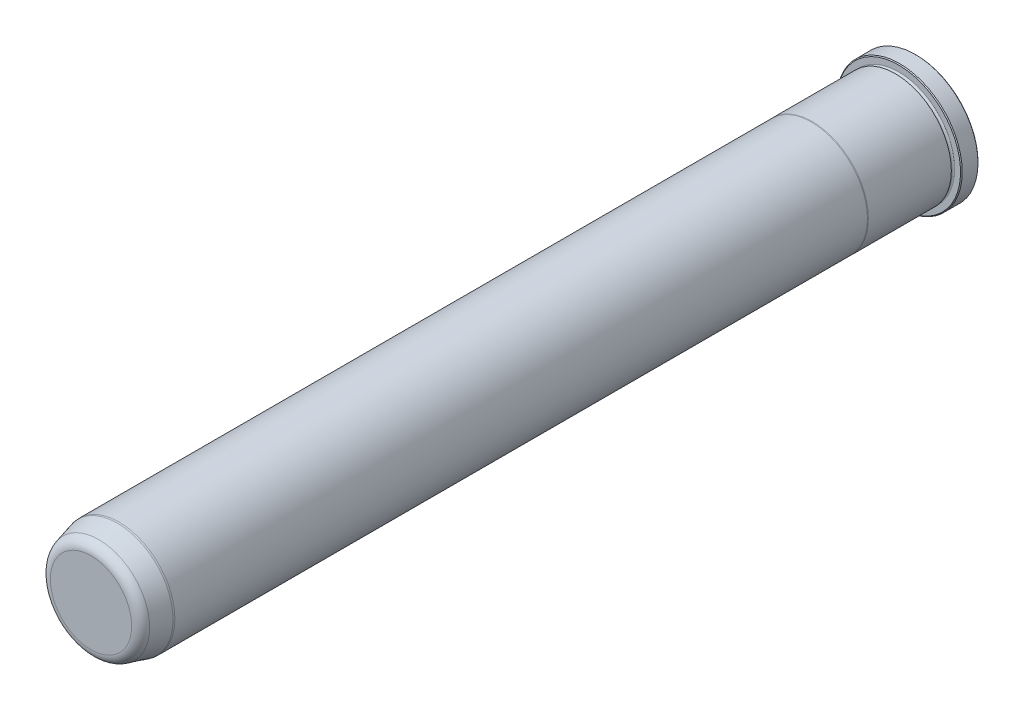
ISO-10303-21;
HEADER;
FILE_DESCRIPTION(('STEP AP214'),'2;1');
FILE_NAME('part.step','',(''),(''),'','','');
FILE_SCHEMA(('AUTOMOTIVE_DESIGN { 1 0 10303 214 1 1 1 1 }'));
ENDSEC;
DATA;
#1=APPLICATION_CONTEXT('core data for automotive mechanical design processes');
#2=APPLICATION_PROTOCOL_DEFINITION('international standard','automotive_design',2000,#1);
#3=PRODUCT_CONTEXT('',#1,'mechanical');
#4=PRODUCT('Part','Part','',(#3));
#5=PRODUCT_RELATED_PRODUCT_CATEGORY('part','',(#4));
#6=PRODUCT_DEFINITION_FORMATION('','',#4);
#7=PRODUCT_DEFINITION_CONTEXT('part definition',#1,'design');
#8=PRODUCT_DEFINITION('design','',#6,#7);
#9=PRODUCT_DEFINITION_SHAPE('','',#8);
#10=(LENGTH_UNIT() NAMED_UNIT(*) SI_UNIT(.MILLI.,.METRE.));
#11=(NAMED_UNIT(*) PLANE_ANGLE_UNIT() SI_UNIT($,.RADIAN.));
#12=(NAMED_UNIT(*) SI_UNIT($,.STERADIAN.) SOLID_ANGLE_UNIT());
#13=UNCERTAINTY_MEASURE_WITH_UNIT(LENGTH_MEASURE(1.E-05),#10,'distance_accuracy_value','');
#14=(GEOMETRIC_REPRESENTATION_CONTEXT(3) GLOBAL_UNCERTAINTY_ASSIGNED_CONTEXT((#13)) GLOBAL_UNIT_ASSIGNED_CONTEXT((#10,
#11,#12)) REPRESENTATION_CONTEXT('',''));
#15=CARTESIAN_POINT('',(0.,0.,0.));
#16=DIRECTION('',(0.,0.,1.));
#17=DIRECTION('',(1.,0.,0.));
#18=AXIS2_PLACEMENT_3D('',#15,#16,#17);
#19=CARTESIAN_POINT('',(0.,0.,0.));
#20=DIRECTION('',(0.,0.,1.));
#21=DIRECTION('',(1.,0.,0.));
#22=AXIS2_PLACEMENT_3D('',#19,#20,#21);
#23=PLANE('',#22);
#24=CARTESIAN_POINT('',(0.,0.,0.));
#25=DIRECTION('',(0.,0.,1.));
#26=DIRECTION('',(1.,0.,0.));
#27=AXIS2_PLACEMENT_3D('',#24,#25,#26);
#28=CIRCLE('',#27,28.067);
#29=CARTESIAN_POINT('',(28.067,0.,0.));
#30=VERTEX_POINT('',#29);
#31=EDGE_CURVE('E37',#30,#30,#28,.F.);
#32=ORIENTED_EDGE('',*,*,#31,.T.);
#33=EDGE_LOOP('',(#32));
#34=FACE_BOUND('',#33,.T.);
#35=ADVANCED_FACE('F30',(#34),#23,.F.);
#36=CARTESIAN_POINT('',(0.,0.,0.));
#37=DIRECTION('',(0.,0.,1.));
#38=DIRECTION('',(1.,0.,0.));
#39=AXIS2_PLACEMENT_3D('',#36,#37,#38);
#40=CYLINDRICAL_SURFACE('',#39,28.448);
#41=CARTESIAN_POINT('',(0.,0.,0.380999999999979));
#42=DIRECTION('',(0.,0.,1.));
#43=DIRECTION('',(1.,0.,0.));
#44=AXIS2_PLACEMENT_3D('',#41,#42,#43);
#45=CIRCLE('',#44,28.448);
#46=CARTESIAN_POINT('',(28.448,0.,0.380999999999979));
#47=VERTEX_POINT('',#46);
#48=EDGE_CURVE('E41',#47,#47,#45,.T.);
#49=ORIENTED_EDGE('',*,*,#48,.T.);
#50=EDGE_LOOP('',(#49));
#51=FACE_BOUND('',#50,.T.);
#52=CARTESIAN_POINT('',(0.,0.,7.54380000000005));
#53=DIRECTION('',(0.,0.,-1.));
#54=DIRECTION('',(-1.,0.,0.));
#55=AXIS2_PLACEMENT_3D('',#52,#53,#54);
#56=CIRCLE('',#55,28.448);
#57=CARTESIAN_POINT('',(-28.448,0.,7.54380000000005));
#58=VERTEX_POINT('',#57);
#59=EDGE_CURVE('E45',#58,#58,#56,.T.);
#60=ORIENTED_EDGE('',*,*,#59,.T.);
#61=EDGE_LOOP('',(#60));
#62=FACE_BOUND('',#61,.T.);
#63=ADVANCED_FACE('F118',(#51,#62),#40,.T.);
#64=CARTESIAN_POINT('',(0.,28.448,7.9248));
#65=DIRECTION('',(0.,0.,-1.));
#66=DIRECTION('',(-1.,0.,0.));
#67=AXIS2_PLACEMENT_3D('',#64,#65,#66);
#68=PLANE('',#67);
#69=CARTESIAN_POINT('',(0.,0.,7.9248));
#70=DIRECTION('',(0.,0.,-1.));
#71=DIRECTION('',(-1.,0.,0.));
#72=AXIS2_PLACEMENT_3D('',#69,#70,#71);
#73=CIRCLE('',#72,28.067);
#74=CARTESIAN_POINT('',(-28.067,0.,7.9248));
#75=VERTEX_POINT('',#74);
#76=EDGE_CURVE('E10',#75,#75,#73,.F.);
#77=ORIENTED_EDGE('',*,*,#76,.T.);
#78=EDGE_LOOP('',(#77));
#79=FACE_BOUND('',#78,.T.);
#80=CARTESIAN_POINT('',(0.,0.,7.9248));
#81=DIRECTION('',(0.,0.,1.));
#82=DIRECTION('',(1.,0.,0.));
#83=AXIS2_PLACEMENT_3D('',#80,#81,#82);
#84=CIRCLE('',#83,25.3873);
#85=CARTESIAN_POINT('',(25.3873,0.,7.9248));
#86=VERTEX_POINT('',#85);
#87=EDGE_CURVE('E56',#86,#86,#84,.T.);
#88=ORIENTED_EDGE('',*,*,#87,.F.);
#89=EDGE_LOOP('',(#88));
#90=FACE_BOUND('',#89,.T.);
#91=ADVANCED_FACE('F113',(#79,#90),#68,.F.);
#92=CARTESIAN_POINT('',(0.,0.,8.6868));
#93=DIRECTION('',(0.,0.,1.));
#94=DIRECTION('',(1.,0.,0.));
#95=AXIS2_PLACEMENT_3D('',#92,#93,#94);
#96=TOROIDAL_SURFACE('',#95,25.3873,0.761999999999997);
#97=CARTESIAN_POINT('',(0.,0.,9.44879999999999));
#98=DIRECTION('',(0.,0.,1.));
#99=DIRECTION('',(1.,0.,0.));
#100=AXIS2_PLACEMENT_3D('',#97,#98,#99);
#101=CIRCLE('',#100,25.3873);
#102=CARTESIAN_POINT('',(25.3873,0.,9.44879999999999));
#103=VERTEX_POINT('',#102);
#104=EDGE_CURVE('E59',#103,#103,#101,.T.);
#105=ORIENTED_EDGE('',*,*,#104,.F.);
#106=EDGE_LOOP('',(#105));
#107=FACE_BOUND('',#106,.T.);
#108=ORIENTED_EDGE('',*,*,#87,.T.);
#109=EDGE_LOOP('',(#108));
#110=FACE_BOUND('',#109,.T.);
#111=ADVANCED_FACE('F107',(#107,#110),#96,.F.);
#112=CARTESIAN_POINT('',(0.,25.3873,9.44879999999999));
#113=DIRECTION('',(0.,0.,1.));
#114=DIRECTION('',(1.,0.,0.));
#115=AXIS2_PLACEMENT_3D('',#112,#113,#114);
#116=PLANE('',#115);
#117=CARTESIAN_POINT('',(0.,0.,9.4488));
#118=DIRECTION('',(0.,0.,1.));
#119=DIRECTION('',(1.,0.,0.));
#120=AXIS2_PLACEMENT_3D('',#117,#118,#119);
#121=CIRCLE('',#120,25.4127);
#122=CARTESIAN_POINT('',(25.4127,0.,9.4488));
#123=VERTEX_POINT('',#122);
#124=EDGE_CURVE('E62',#123,#123,#121,.T.);
#125=ORIENTED_EDGE('',*,*,#124,.F.);
#126=EDGE_LOOP('',(#125));
#127=FACE_BOUND('',#126,.T.);
#128=ORIENTED_EDGE('',*,*,#104,.T.);
#129=EDGE_LOOP('',(#128));
#130=FACE_BOUND('',#129,.T.);
#131=ADVANCED_FACE('F101',(#127,#130),#116,.F.);
#132=CARTESIAN_POINT('',(0.,0.,0.));
#133=DIRECTION('',(0.,0.,1.));
#134=DIRECTION('',(1.,0.,0.));
#135=AXIS2_PLACEMENT_3D('',#132,#133,#134);
#136=CYLINDRICAL_SURFACE('',#135,25.4127);
#137=CARTESIAN_POINT('',(0.,0.,47.1347630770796));
#138=DIRECTION('',(0.,0.,1.));
#139=DIRECTION('',(1.,0.,0.));
#140=AXIS2_PLACEMENT_3D('',#137,#138,#139);
#141=CIRCLE('',#140,25.4127);
#142=CARTESIAN_POINT('',(25.4127,0.,47.1347630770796));
#143=VERTEX_POINT('',#142);
#144=EDGE_CURVE('E65',#143,#143,#141,.T.);
#145=ORIENTED_EDGE('',*,*,#144,.F.);
#146=EDGE_LOOP('',(#145));
#147=FACE_BOUND('',#146,.T.);
#148=ORIENTED_EDGE('',*,*,#124,.T.);
#149=EDGE_LOOP('',(#148));
#150=FACE_BOUND('',#149,.T.);
#151=ADVANCED_FACE('F95',(#147,#150),#136,.T.);
#152=CARTESIAN_POINT('',(0.,0.,47.1347630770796));
#153=DIRECTION('',(0.,0.,-1.));
#154=DIRECTION('',(-1.,0.,0.));
#155=AXIS2_PLACEMENT_3D('',#152,#153,#154);
#156=CONICAL_SURFACE('',#155,25.4127,0.0698131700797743);
#157=CARTESIAN_POINT('',(0.,0.,47.498));
#158=DIRECTION('',(0.,0.,1.));
#159=DIRECTION('',(1.,0.,0.));
#160=AXIS2_PLACEMENT_3D('',#157,#158,#159);
#161=CIRCLE('',#160,25.3873);
#162=CARTESIAN_POINT('',(25.3873,0.,47.498));
#163=VERTEX_POINT('',#162);
#164=EDGE_CURVE('E68',#163,#163,#161,.T.);
#165=ORIENTED_EDGE('',*,*,#164,.F.);
#166=EDGE_LOOP('',(#165));
#167=FACE_BOUND('',#166,.T.);
#168=ORIENTED_EDGE('',*,*,#144,.T.);
#169=EDGE_LOOP('',(#168));
#170=FACE_BOUND('',#169,.T.);
#171=ADVANCED_FACE('F89',(#167,#170),#156,.T.);
#172=CARTESIAN_POINT('',(0.,0.,0.));
#173=DIRECTION('',(0.,0.,1.));
#174=DIRECTION('',(1.,0.,0.));
#175=AXIS2_PLACEMENT_3D('',#172,#173,#174);
#176=CYLINDRICAL_SURFACE('',#175,25.3873);
#177=CARTESIAN_POINT('',(0.,0.,361.95));
#178=DIRECTION('',(0.,0.,1.));
#179=DIRECTION('',(1.,0.,0.));
#180=AXIS2_PLACEMENT_3D('',#177,#178,#179);
#181=CIRCLE('',#180,25.3873);
#182=CARTESIAN_POINT('',(25.3873,0.,361.95));
#183=VERTEX_POINT('',#182);
#184=EDGE_CURVE('E71',#183,#183,#181,.T.);
#185=ORIENTED_EDGE('',*,*,#184,.F.);
#186=EDGE_LOOP('',(#185));
#187=FACE_BOUND('',#186,.T.);
#188=ORIENTED_EDGE('',*,*,#164,.T.);
#189=EDGE_LOOP('',(#188));
#190=FACE_BOUND('',#189,.T.);
#191=ADVANCED_FACE('F83',(#187,#190),#176,.T.);
#192=CARTESIAN_POINT('',(0.,0.,361.95));
#193=DIRECTION('',(0.,0.,-1.));
#194=DIRECTION('',(-1.,0.,0.));
#195=AXIS2_PLACEMENT_3D('',#192,#193,#194);
#196=CONICAL_SURFACE('',#195,25.3873,0.0872664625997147);
#197=CARTESIAN_POINT('',(0.,0.,362.712));
#198=DIRECTION('',(0.,0.,1.));
#199=DIRECTION('',(1.,0.,0.));
#200=AXIS2_PLACEMENT_3D('',#197,#198,#199);
#201=CIRCLE('',#200,25.3206336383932);
#202=CARTESIAN_POINT('',(25.3206336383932,0.,362.712));
#203=VERTEX_POINT('',#202);
#204=EDGE_CURVE('E74',#203,#203,#201,.T.);
#205=ORIENTED_EDGE('',*,*,#204,.F.);
#206=EDGE_LOOP('',(#205));
#207=FACE_BOUND('',#206,.T.);
#208=ORIENTED_EDGE('',*,*,#184,.T.);
#209=EDGE_LOOP('',(#208));
#210=FACE_BOUND('',#209,.T.);
#211=ADVANCED_FACE('F80',(#207,#210),#196,.T.);
#212=CARTESIAN_POINT('',(0.,0.,362.712));
#213=DIRECTION('',(0.,0.,-1.));
#214=DIRECTION('',(-1.,0.,0.));
#215=AXIS2_PLACEMENT_3D('',#212,#213,#214);
#216=CONICAL_SURFACE('',#215,25.3206336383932,0.26179938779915);
#217=CARTESIAN_POINT('',(0.,0.,371.120125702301));
#218=DIRECTION('',(0.,0.,1.));
#219=DIRECTION('',(1.,0.,0.));
#220=AXIS2_PLACEMENT_3D('',#217,#218,#219);
#221=CIRCLE('',#220,23.0676831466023);
#222=CARTESIAN_POINT('',(23.0676831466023,0.,371.120125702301));
#223=VERTEX_POINT('',#222);
#224=EDGE_CURVE('E50',#223,#223,#221,.F.);
#225=ORIENTED_EDGE('',*,*,#224,.T.);
#226=EDGE_LOOP('',(#225));
#227=FACE_BOUND('',#226,.T.);
#228=ORIENTED_EDGE('',*,*,#204,.T.);
#229=EDGE_LOOP('',(#228));
#230=FACE_BOUND('',#229,.T.);
#231=ADVANCED_FACE('F78',(#227,#230),#216,.T.);
#232=CARTESIAN_POINT('',(0.,22.1218561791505,374.65));
#233=DIRECTION('',(0.,0.,-1.));
#234=DIRECTION('',(-1.,0.,0.));
#235=AXIS2_PLACEMENT_3D('',#232,#233,#234);
#236=PLANE('',#235);
#237=CARTESIAN_POINT('',(0.,0.,374.65));
#238=DIRECTION('',(0.,0.,-1.));
#239=DIRECTION('',(-1.,0.,0.));
#240=AXIS2_PLACEMENT_3D('',#237,#238,#239);
#241=CIRCLE('',#240,18.4674613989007);
#242=CARTESIAN_POINT('',(-18.4674613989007,0.,374.65));
#243=VERTEX_POINT('',#242);
#244=EDGE_CURVE('E53',#243,#243,#241,.F.);
#245=ORIENTED_EDGE('',*,*,#244,.T.);
#246=EDGE_LOOP('',(#245));
#247=FACE_BOUND('',#246,.T.);
#248=ADVANCED_FACE('F133',(#247),#236,.F.);
#249=CARTESIAN_POINT('',(0.,0.,369.8875));
#250=DIRECTION('',(0.,0.,-1.));
#251=DIRECTION('',(-1.,0.,0.));
#252=AXIS2_PLACEMENT_3D('',#249,#250,#251);
#253=TOROIDAL_SURFACE('',#252,18.4674613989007,4.7625);
#254=ORIENTED_EDGE('',*,*,#224,.F.);
#255=EDGE_LOOP('',(#254));
#256=FACE_BOUND('',#255,.T.);
#257=ORIENTED_EDGE('',*,*,#244,.F.);
#258=EDGE_LOOP('',(#257));
#259=FACE_BOUND('',#258,.T.);
#260=ADVANCED_FACE('F130',(#256,#259),#253,.T.);
#261=CARTESIAN_POINT('',(0.,0.,0.380999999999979));
#262=DIRECTION('',(0.,0.,1.));
#263=DIRECTION('',(1.,0.,0.));
#264=AXIS2_PLACEMENT_3D('',#261,#262,#263);
#265=CONICAL_SURFACE('',#264,28.448,0.785398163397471);
#266=ORIENTED_EDGE('',*,*,#31,.F.);
#267=EDGE_LOOP('',(#266));
#268=FACE_BOUND('',#267,.T.);
#269=ORIENTED_EDGE('',*,*,#48,.F.);
#270=EDGE_LOOP('',(#269));
#271=FACE_BOUND('',#270,.T.);
#272=ADVANCED_FACE('F132',(#268,#271),#265,.T.);
#273=CARTESIAN_POINT('',(0.,0.,7.9248));
#274=DIRECTION('',(0.,0.,-1.));
#275=DIRECTION('',(-1.,0.,0.));
#276=AXIS2_PLACEMENT_3D('',#273,#274,#275);
#277=CONICAL_SURFACE('',#276,28.067,0.785398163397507);
#278=ORIENTED_EDGE('',*,*,#59,.F.);
#279=EDGE_LOOP('',(#278));
#280=FACE_BOUND('',#279,.T.);
#281=ORIENTED_EDGE('',*,*,#76,.F.);
#282=EDGE_LOOP('',(#281));
#283=FACE_BOUND('',#282,.T.);
#284=ADVANCED_FACE('F32',(#280,#283),#277,.T.);
#285=CLOSED_SHELL('',(#35,#63,#91,#111,#131,#151,#171,#191,#211,#231,#248,#260,#272,#284));
#286=MANIFOLD_SOLID_BREP('B2',#285);
#287=ADVANCED_BREP_SHAPE_REPRESENTATION('',(#18,#286),#14);
#288=SHAPE_DEFINITION_REPRESENTATION(#9,#287);
ENDSEC;
END-ISO-10303-21;
